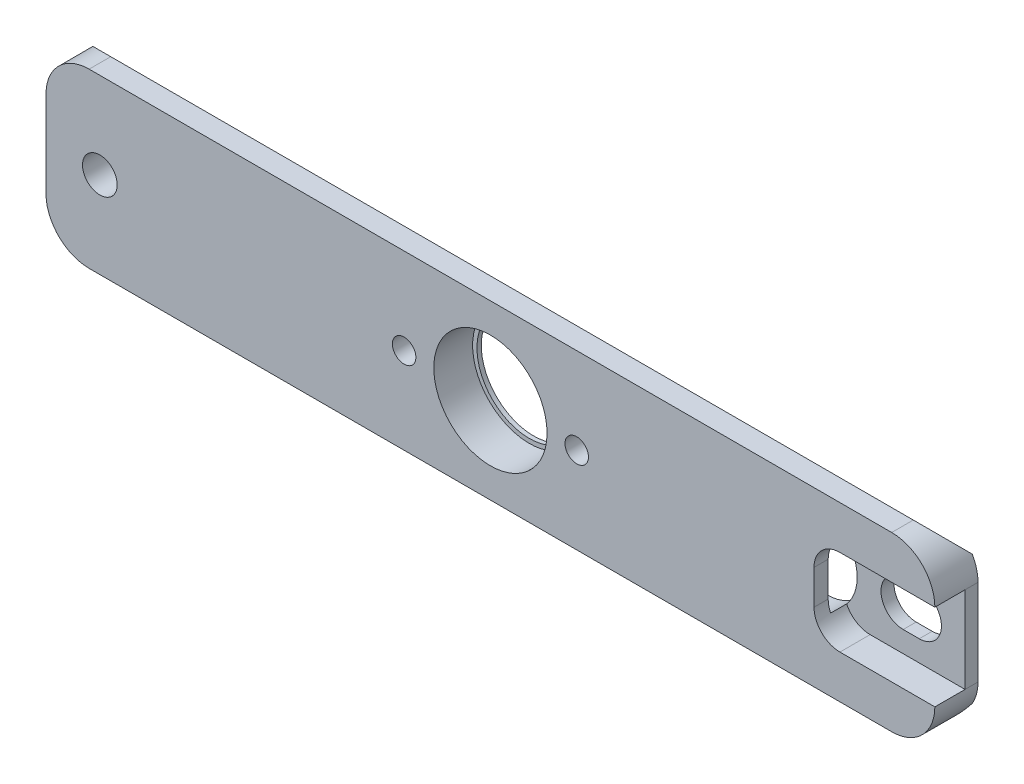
ISO-10303-21;
HEADER;
FILE_DESCRIPTION(('STEP AP214'),'2;1');
FILE_NAME('part.step','',(''),(''),'','','');
FILE_SCHEMA(('AUTOMOTIVE_DESIGN { 1 0 10303 214 1 1 1 1 }'));
ENDSEC;
DATA;
#1=APPLICATION_CONTEXT('core data for automotive mechanical design processes');
#2=APPLICATION_PROTOCOL_DEFINITION('international standard','automotive_design',2000,#1);
#3=PRODUCT_CONTEXT('',#1,'mechanical');
#4=PRODUCT('Part','Part','',(#3));
#5=PRODUCT_RELATED_PRODUCT_CATEGORY('part','',(#4));
#6=PRODUCT_DEFINITION_FORMATION('','',#4);
#7=PRODUCT_DEFINITION_CONTEXT('part definition',#1,'design');
#8=PRODUCT_DEFINITION('design','',#6,#7);
#9=PRODUCT_DEFINITION_SHAPE('','',#8);
#10=(LENGTH_UNIT() NAMED_UNIT(*) SI_UNIT(.MILLI.,.METRE.));
#11=(NAMED_UNIT(*) PLANE_ANGLE_UNIT() SI_UNIT($,.RADIAN.));
#12=(NAMED_UNIT(*) SI_UNIT($,.STERADIAN.) SOLID_ANGLE_UNIT());
#13=UNCERTAINTY_MEASURE_WITH_UNIT(LENGTH_MEASURE(1.E-05),#10,'distance_accuracy_value','');
#14=(GEOMETRIC_REPRESENTATION_CONTEXT(3) GLOBAL_UNCERTAINTY_ASSIGNED_CONTEXT((#13)) GLOBAL_UNIT_ASSIGNED_CONTEXT((#10,
#11,#12)) REPRESENTATION_CONTEXT('',''));
#15=CARTESIAN_POINT('',(0.,0.,0.));
#16=DIRECTION('',(0.,0.,1.));
#17=DIRECTION('',(1.,0.,0.));
#18=AXIS2_PLACEMENT_3D('',#15,#16,#17);
#19=CARTESIAN_POINT('',(47.625,2.54,1.905));
#20=DIRECTION('',(-1.,0.,0.));
#21=DIRECTION('',(0.,0.,1.));
#22=AXIS2_PLACEMENT_3D('',#19,#20,#21);
#23=PLANE('',#22);
#24=DIRECTION('',(0.,-1.,0.));
#25=VECTOR('',#24,1.);
#26=CARTESIAN_POINT('',(47.625,2.54,4.2672));
#27=LINE('',#26,#25);
#28=CARTESIAN_POINT('',(47.625,2.54,4.2672));
#29=VERTEX_POINT('',#28);
#30=CARTESIAN_POINT('',(47.625,-2.54,4.2672));
#31=VERTEX_POINT('',#30);
#32=EDGE_CURVE('E269',#29,#31,#27,.T.);
#33=ORIENTED_EDGE('',*,*,#32,.F.);
#34=DIRECTION('',(0.,0.,1.));
#35=VECTOR('',#34,1.);
#36=CARTESIAN_POINT('',(47.625,2.54,1.905));
#37=LINE('',#36,#35);
#38=CARTESIAN_POINT('',(47.625,2.54,6.35));
#39=VERTEX_POINT('',#38);
#40=EDGE_CURVE('E275',#29,#39,#37,.T.);
#41=ORIENTED_EDGE('',*,*,#40,.T.);
#42=DIRECTION('',(0.,-1.,0.));
#43=VECTOR('',#42,1.);
#44=CARTESIAN_POINT('',(47.625,2.54,6.35));
#45=LINE('',#44,#43);
#46=CARTESIAN_POINT('',(47.625,-2.54,6.35));
#47=VERTEX_POINT('',#46);
#48=EDGE_CURVE('E442',#39,#47,#45,.T.);
#49=ORIENTED_EDGE('',*,*,#48,.T.);
#50=DIRECTION('',(0.,0.,1.));
#51=VECTOR('',#50,1.);
#52=CARTESIAN_POINT('',(47.625,-2.54,1.905));
#53=LINE('',#52,#51);
#54=EDGE_CURVE('E282',#31,#47,#53,.T.);
#55=ORIENTED_EDGE('',*,*,#54,.F.);
#56=EDGE_LOOP('',(#33,#41,#49,#55));
#57=FACE_BOUND('',#56,.T.);
#58=ADVANCED_FACE('F111',(#57),#23,.F.);
#59=CARTESIAN_POINT('',(65.405,12.7,6.35));
#60=DIRECTION('',(-1.,0.,0.));
#61=DIRECTION('',(0.,-1.,0.));
#62=AXIS2_PLACEMENT_3D('',#59,#60,#61);
#63=PLANE('',#62);
#64=DIRECTION('',(0.,1.,0.));
#65=VECTOR('',#64,1.);
#66=CARTESIAN_POINT('',(65.405,12.7,1.905));
#67=LINE('',#66,#65);
#68=CARTESIAN_POINT('',(65.405,-6.35,1.905));
#69=VERTEX_POINT('',#68);
#70=CARTESIAN_POINT('',(65.405,6.35,1.905));
#71=VERTEX_POINT('',#70);
#72=EDGE_CURVE('E296',#69,#71,#67,.T.);
#73=ORIENTED_EDGE('',*,*,#72,.F.);
#74=DIRECTION('',(0.,0.,-1.));
#75=VECTOR('',#74,1.);
#76=CARTESIAN_POINT('',(65.405,-6.35,6.35));
#77=LINE('',#76,#75);
#78=CARTESIAN_POINT('',(65.405,-6.35,0.));
#79=VERTEX_POINT('',#78);
#80=EDGE_CURVE('E373',#69,#79,#77,.T.);
#81=ORIENTED_EDGE('',*,*,#80,.T.);
#82=DIRECTION('',(0.,1.,0.));
#83=VECTOR('',#82,1.);
#84=CARTESIAN_POINT('',(65.405,12.7,0.));
#85=LINE('',#84,#83);
#86=CARTESIAN_POINT('',(65.405,6.35,0.));
#87=VERTEX_POINT('',#86);
#88=EDGE_CURVE('E325',#79,#87,#85,.T.);
#89=ORIENTED_EDGE('',*,*,#88,.T.);
#90=DIRECTION('',(0.,0.,-1.));
#91=VECTOR('',#90,1.);
#92=CARTESIAN_POINT('',(65.405,6.35,6.35));
#93=LINE('',#92,#91);
#94=EDGE_CURVE('E370',#87,#71,#93,.F.);
#95=ORIENTED_EDGE('',*,*,#94,.T.);
#96=EDGE_LOOP('',(#73,#81,#89,#95));
#97=FACE_BOUND('',#96,.T.);
#98=ADVANCED_FACE('F473',(#97),#63,.F.);
#99=CARTESIAN_POINT('',(58.6613,0.,0.));
#100=DIRECTION('',(0.,0.,-1.));
#101=DIRECTION('',(-1.,0.,0.));
#102=AXIS2_PLACEMENT_3D('',#99,#100,#101);
#103=CYLINDRICAL_SURFACE('',#102,3.2639);
#104=CARTESIAN_POINT('',(58.6613,0.,1.905));
#105=DIRECTION('',(0.,0.,1.));
#106=DIRECTION('',(1.,0.,0.));
#107=AXIS2_PLACEMENT_3D('',#104,#105,#106);
#108=CIRCLE('',#107,3.2639);
#109=CARTESIAN_POINT('',(58.6613,3.2639,1.905));
#110=VERTEX_POINT('',#109);
#111=CARTESIAN_POINT('',(58.6613,-3.2639,1.905));
#112=VERTEX_POINT('',#111);
#113=EDGE_CURVE('E292',#110,#112,#108,.F.);
#114=ORIENTED_EDGE('',*,*,#113,.F.);
#115=DIRECTION('',(0.,0.,-1.));
#116=VECTOR('',#115,1.);
#117=CARTESIAN_POINT('',(58.6613,3.2639,0.));
#118=LINE('',#117,#116);
#119=CARTESIAN_POINT('',(58.6613,3.26390000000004,0.));
#120=VERTEX_POINT('',#119);
#121=EDGE_CURVE('E316',#120,#110,#118,.F.);
#122=ORIENTED_EDGE('',*,*,#121,.F.);
#123=CARTESIAN_POINT('',(58.6613,0.,0.));
#124=DIRECTION('',(0.,0.,-1.));
#125=DIRECTION('',(-1.,0.,0.));
#126=AXIS2_PLACEMENT_3D('',#123,#124,#125);
#127=CIRCLE('',#126,3.2639);
#128=CARTESIAN_POINT('',(58.6613,-3.2639,0.));
#129=VERTEX_POINT('',#128);
#130=EDGE_CURVE('E311',#120,#129,#127,.T.);
#131=ORIENTED_EDGE('',*,*,#130,.T.);
#132=DIRECTION('',(0.,0.,-1.));
#133=VECTOR('',#132,1.);
#134=CARTESIAN_POINT('',(58.6613,-3.2639,0.));
#135=LINE('',#134,#133);
#136=EDGE_CURVE('E314',#112,#129,#135,.T.);
#137=ORIENTED_EDGE('',*,*,#136,.F.);
#138=EDGE_LOOP('',(#114,#122,#131,#137));
#139=FACE_BOUND('',#138,.T.);
#140=ADVANCED_FACE('F543',(#139),#103,.F.);
#141=CARTESIAN_POINT('',(56.2991,0.,0.));
#142=DIRECTION('',(0.,0.,-1.));
#143=DIRECTION('',(-1.,0.,0.));
#144=AXIS2_PLACEMENT_3D('',#141,#142,#143);
#145=CYLINDRICAL_SURFACE('',#144,3.2639);
#146=CARTESIAN_POINT('',(56.2991,0.,1.905));
#147=DIRECTION('',(0.,0.,1.));
#148=DIRECTION('',(1.,0.,0.));
#149=AXIS2_PLACEMENT_3D('',#146,#147,#148);
#150=CIRCLE('',#149,3.2639);
#151=CARTESIAN_POINT('',(56.2991,-3.2639,1.905));
#152=VERTEX_POINT('',#151);
#153=CARTESIAN_POINT('',(56.2991,3.2639,1.905));
#154=VERTEX_POINT('',#153);
#155=EDGE_CURVE('E134',#152,#154,#150,.F.);
#156=ORIENTED_EDGE('',*,*,#155,.F.);
#157=DIRECTION('',(0.,0.,-1.));
#158=VECTOR('',#157,1.);
#159=CARTESIAN_POINT('',(56.2991,-3.2639,0.));
#160=LINE('',#159,#158);
#161=CARTESIAN_POINT('',(56.2991,-3.2639,0.));
#162=VERTEX_POINT('',#161);
#163=EDGE_CURVE('E308',#162,#152,#160,.F.);
#164=ORIENTED_EDGE('',*,*,#163,.F.);
#165=CARTESIAN_POINT('',(56.2991,0.,0.));
#166=DIRECTION('',(0.,0.,-1.));
#167=DIRECTION('',(-1.,0.,0.));
#168=AXIS2_PLACEMENT_3D('',#165,#166,#167);
#169=CIRCLE('',#168,3.2639);
#170=CARTESIAN_POINT('',(56.2991,3.2639,0.));
#171=VERTEX_POINT('',#170);
#172=EDGE_CURVE('E303',#162,#171,#169,.T.);
#173=ORIENTED_EDGE('',*,*,#172,.T.);
#174=DIRECTION('',(0.,0.,-1.));
#175=VECTOR('',#174,1.);
#176=CARTESIAN_POINT('',(56.2991,3.2639,0.));
#177=LINE('',#176,#175);
#178=EDGE_CURVE('E306',#154,#171,#177,.T.);
#179=ORIENTED_EDGE('',*,*,#178,.F.);
#180=EDGE_LOOP('',(#156,#164,#173,#179));
#181=FACE_BOUND('',#180,.T.);
#182=ADVANCED_FACE('F560',(#181),#145,.F.);
#183=CARTESIAN_POINT('',(56.2991,-3.2639,0.));
#184=DIRECTION('',(0.,-1.,0.));
#185=DIRECTION('',(0.,0.,-1.));
#186=AXIS2_PLACEMENT_3D('',#183,#184,#185);
#187=PLANE('',#186);
#188=DIRECTION('',(-1.,0.,0.));
#189=VECTOR('',#188,1.);
#190=CARTESIAN_POINT('',(56.2991,-3.2639,1.905));
#191=LINE('',#190,#189);
#192=EDGE_CURVE('E294',#112,#152,#191,.T.);
#193=ORIENTED_EDGE('',*,*,#192,.F.);
#194=ORIENTED_EDGE('',*,*,#136,.T.);
#195=DIRECTION('',(1.,0.,0.));
#196=VECTOR('',#195,1.);
#197=CARTESIAN_POINT('',(56.2991,-3.2639,0.));
#198=LINE('',#197,#196);
#199=EDGE_CURVE('E300',#162,#129,#198,.T.);
#200=ORIENTED_EDGE('',*,*,#199,.F.);
#201=ORIENTED_EDGE('',*,*,#163,.T.);
#202=EDGE_LOOP('',(#193,#194,#200,#201));
#203=FACE_BOUND('',#202,.T.);
#204=ADVANCED_FACE('F556',(#203),#187,.F.);
#205=CARTESIAN_POINT('',(56.2991,3.2639,0.));
#206=DIRECTION('',(0.,1.,0.));
#207=DIRECTION('',(0.,0.,1.));
#208=AXIS2_PLACEMENT_3D('',#205,#206,#207);
#209=PLANE('',#208);
#210=DIRECTION('',(1.,0.,0.));
#211=VECTOR('',#210,1.);
#212=CARTESIAN_POINT('',(56.2991,3.2639,1.905));
#213=LINE('',#212,#211);
#214=EDGE_CURVE('E262',#154,#110,#213,.T.);
#215=ORIENTED_EDGE('',*,*,#214,.F.);
#216=ORIENTED_EDGE('',*,*,#178,.T.);
#217=DIRECTION('',(1.,0.,0.));
#218=VECTOR('',#217,1.);
#219=CARTESIAN_POINT('',(56.2991,3.26390000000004,0.));
#220=LINE('',#219,#218);
#221=EDGE_CURVE('E298',#171,#120,#220,.T.);
#222=ORIENTED_EDGE('',*,*,#221,.T.);
#223=ORIENTED_EDGE('',*,*,#121,.T.);
#224=EDGE_LOOP('',(#215,#216,#222,#223));
#225=FACE_BOUND('',#224,.T.);
#226=ADVANCED_FACE('F553',(#225),#209,.F.);
#227=CARTESIAN_POINT('',(-65.405,12.7,6.35));
#228=DIRECTION('',(0.,-1.,0.));
#229=DIRECTION('',(0.,0.,-1.));
#230=AXIS2_PLACEMENT_3D('',#227,#228,#229);
#231=PLANE('',#230);
#232=DIRECTION('',(0.,0.,-1.));
#233=VECTOR('',#232,1.);
#234=CARTESIAN_POINT('',(59.055,12.7,6.35));
#235=LINE('',#234,#233);
#236=CARTESIAN_POINT('',(59.055,12.7,6.35));
#237=VERTEX_POINT('',#236);
#238=CARTESIAN_POINT('',(59.055,12.7,3.17500000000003));
#239=VERTEX_POINT('',#238);
#240=EDGE_CURVE('E355',#237,#239,#235,.T.);
#241=ORIENTED_EDGE('',*,*,#240,.T.);
#242=DIRECTION('',(-1.,0.,0.));
#243=VECTOR('',#242,1.);
#244=CARTESIAN_POINT('',(-65.405,12.7,3.17500000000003));
#245=LINE('',#244,#243);
#246=CARTESIAN_POINT('',(-59.055,12.7,3.17500000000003));
#247=VERTEX_POINT('',#246);
#248=EDGE_CURVE('E392',#239,#247,#245,.T.);
#249=ORIENTED_EDGE('',*,*,#248,.T.);
#250=DIRECTION('',(0.,0.,-1.));
#251=VECTOR('',#250,1.);
#252=CARTESIAN_POINT('',(-59.055,12.7,6.35));
#253=LINE('',#252,#251);
#254=CARTESIAN_POINT('',(-59.055,12.7,6.35));
#255=VERTEX_POINT('',#254);
#256=EDGE_CURVE('E358',#247,#255,#253,.F.);
#257=ORIENTED_EDGE('',*,*,#256,.T.);
#258=DIRECTION('',(-1.,0.,0.));
#259=VECTOR('',#258,1.);
#260=CARTESIAN_POINT('',(-65.405,12.7,6.35));
#261=LINE('',#260,#259);
#262=EDGE_CURVE('E326',#237,#255,#261,.T.);
#263=ORIENTED_EDGE('',*,*,#262,.F.);
#264=EDGE_LOOP('',(#241,#249,#257,#263));
#265=FACE_BOUND('',#264,.T.);
#266=ADVANCED_FACE('F535',(#265),#231,.F.);
#267=CARTESIAN_POINT('',(-65.405,12.7,6.35));
#268=DIRECTION('',(1.,0.,0.));
#269=DIRECTION('',(0.,0.,-1.));
#270=AXIS2_PLACEMENT_3D('',#267,#268,#269);
#271=PLANE('',#270);
#272=DIRECTION('',(0.,-1.,0.));
#273=VECTOR('',#272,1.);
#274=CARTESIAN_POINT('',(-65.405,12.7,6.35));
#275=LINE('',#274,#273);
#276=CARTESIAN_POINT('',(-65.405,6.35,6.35));
#277=VERTEX_POINT('',#276);
#278=CARTESIAN_POINT('',(-65.405,-6.35,6.35));
#279=VERTEX_POINT('',#278);
#280=EDGE_CURVE('E329',#277,#279,#275,.T.);
#281=ORIENTED_EDGE('',*,*,#280,.F.);
#282=DIRECTION('',(0.,0.,-1.));
#283=VECTOR('',#282,1.);
#284=CARTESIAN_POINT('',(-65.405,6.35,6.35));
#285=LINE('',#284,#283);
#286=CARTESIAN_POINT('',(-65.405,6.35,0.));
#287=VERTEX_POINT('',#286);
#288=EDGE_CURVE('E342',#277,#287,#285,.T.);
#289=ORIENTED_EDGE('',*,*,#288,.T.);
#290=DIRECTION('',(0.,-1.,0.));
#291=VECTOR('',#290,1.);
#292=CARTESIAN_POINT('',(-65.405,12.7,0.));
#293=LINE('',#292,#291);
#294=CARTESIAN_POINT('',(-65.405,-6.35,0.));
#295=VERTEX_POINT('',#294);
#296=EDGE_CURVE('E330',#287,#295,#293,.T.);
#297=ORIENTED_EDGE('',*,*,#296,.T.);
#298=DIRECTION('',(0.,0.,-1.));
#299=VECTOR('',#298,1.);
#300=CARTESIAN_POINT('',(-65.405,-6.35,6.35));
#301=LINE('',#300,#299);
#302=EDGE_CURVE('E336',#295,#279,#301,.F.);
#303=ORIENTED_EDGE('',*,*,#302,.T.);
#304=EDGE_LOOP('',(#281,#289,#297,#303));
#305=FACE_BOUND('',#304,.T.);
#306=ADVANCED_FACE('F527',(#305),#271,.F.);
#307=CARTESIAN_POINT('',(-65.405,-12.7,6.35));
#308=DIRECTION('',(0.,1.,0.));
#309=DIRECTION('',(0.,0.,1.));
#310=AXIS2_PLACEMENT_3D('',#307,#308,#309);
#311=PLANE('',#310);
#312=DIRECTION('',(0.,0.,-1.));
#313=VECTOR('',#312,1.);
#314=CARTESIAN_POINT('',(-59.055,-12.7,6.35));
#315=LINE('',#314,#313);
#316=CARTESIAN_POINT('',(-59.055,-12.7,6.35));
#317=VERTEX_POINT('',#316);
#318=CARTESIAN_POINT('',(-59.055,-12.7,3.175));
#319=VERTEX_POINT('',#318);
#320=EDGE_CURVE('E376',#317,#319,#315,.T.);
#321=ORIENTED_EDGE('',*,*,#320,.T.);
#322=DIRECTION('',(1.,0.,0.));
#323=VECTOR('',#322,1.);
#324=CARTESIAN_POINT('',(-65.405,-12.7,3.175));
#325=LINE('',#324,#323);
#326=CARTESIAN_POINT('',(59.055,-12.7,3.175));
#327=VERTEX_POINT('',#326);
#328=EDGE_CURVE('E381',#319,#327,#325,.T.);
#329=ORIENTED_EDGE('',*,*,#328,.T.);
#330=DIRECTION('',(0.,0.,-1.));
#331=VECTOR('',#330,1.);
#332=CARTESIAN_POINT('',(59.055,-12.7,6.35));
#333=LINE('',#332,#331);
#334=CARTESIAN_POINT('',(59.055,-12.7,6.35));
#335=VERTEX_POINT('',#334);
#336=EDGE_CURVE('E379',#327,#335,#333,.F.);
#337=ORIENTED_EDGE('',*,*,#336,.T.);
#338=DIRECTION('',(1.,0.,0.));
#339=VECTOR('',#338,1.);
#340=CARTESIAN_POINT('',(-65.405,-12.7,6.35));
#341=LINE('',#340,#339);
#342=EDGE_CURVE('E333',#317,#335,#341,.T.);
#343=ORIENTED_EDGE('',*,*,#342,.F.);
#344=EDGE_LOOP('',(#321,#329,#337,#343));
#345=FACE_BOUND('',#344,.T.);
#346=ADVANCED_FACE('F525',(#345),#311,.F.);
#347=CARTESIAN_POINT('',(0.,0.,6.35));
#348=DIRECTION('',(0.,0.,1.));
#349=DIRECTION('',(1.,0.,0.));
#350=AXIS2_PLACEMENT_3D('',#347,#348,#349);
#351=PLANE('',#350);
#352=CARTESIAN_POINT('',(0.,0.,6.35));
#353=DIRECTION('',(0.,0.,1.));
#354=DIRECTION('',(1.,0.,0.));
#355=AXIS2_PLACEMENT_3D('',#352,#353,#354);
#356=CIRCLE('',#355,8.334375);
#357=CARTESIAN_POINT('',(8.334375,0.,6.35));
#358=VERTEX_POINT('',#357);
#359=EDGE_CURVE('E402',#358,#358,#356,.T.);
#360=ORIENTED_EDGE('',*,*,#359,.F.);
#361=EDGE_LOOP('',(#360));
#362=FACE_BOUND('',#361,.T.);
#363=CARTESIAN_POINT('',(12.7,0.,6.35));
#364=DIRECTION('',(0.,0.,-1.));
#365=DIRECTION('',(-1.,0.,0.));
#366=AXIS2_PLACEMENT_3D('',#363,#364,#365);
#367=CIRCLE('',#366,1.7272);
#368=CARTESIAN_POINT('',(10.9728,0.,6.35));
#369=VERTEX_POINT('',#368);
#370=EDGE_CURVE('E422',#369,#369,#367,.T.);
#371=ORIENTED_EDGE('',*,*,#370,.T.);
#372=EDGE_LOOP('',(#371));
#373=FACE_BOUND('',#372,.T.);
#374=CARTESIAN_POINT('',(-12.7,0.,6.35));
#375=DIRECTION('',(0.,0.,-1.));
#376=DIRECTION('',(-1.,0.,0.));
#377=AXIS2_PLACEMENT_3D('',#374,#375,#376);
#378=CIRCLE('',#377,1.7272);
#379=CARTESIAN_POINT('',(-14.4272,0.,6.35));
#380=VERTEX_POINT('',#379);
#381=EDGE_CURVE('E428',#380,#380,#378,.T.);
#382=ORIENTED_EDGE('',*,*,#381,.T.);
#383=EDGE_LOOP('',(#382));
#384=FACE_BOUND('',#383,.T.);
#385=DIRECTION('',(1.,0.,0.));
#386=VECTOR('',#385,1.);
#387=CARTESIAN_POINT('',(51.435,-6.35,6.35));
#388=LINE('',#387,#386);
#389=CARTESIAN_POINT('',(51.435,-6.35,6.35));
#390=VERTEX_POINT('',#389);
#391=CARTESIAN_POINT('',(65.405,-6.35,6.35));
#392=VERTEX_POINT('',#391);
#393=EDGE_CURVE('E434',#390,#392,#388,.T.);
#394=ORIENTED_EDGE('',*,*,#393,.F.);
#395=CARTESIAN_POINT('',(51.435,-2.54,6.35));
#396=DIRECTION('',(0.,0.,1.));
#397=DIRECTION('',(1.,0.,0.));
#398=AXIS2_PLACEMENT_3D('',#395,#396,#397);
#399=CIRCLE('',#398,3.81);
#400=EDGE_CURVE('E444',#47,#390,#399,.T.);
#401=ORIENTED_EDGE('',*,*,#400,.F.);
#402=ORIENTED_EDGE('',*,*,#48,.F.);
#403=CARTESIAN_POINT('',(51.435,2.54,6.35));
#404=DIRECTION('',(0.,0.,1.));
#405=DIRECTION('',(1.,0.,0.));
#406=AXIS2_PLACEMENT_3D('',#403,#404,#405);
#407=CIRCLE('',#406,3.81);
#408=CARTESIAN_POINT('',(51.435,6.35,6.35));
#409=VERTEX_POINT('',#408);
#410=EDGE_CURVE('E278',#409,#39,#407,.T.);
#411=ORIENTED_EDGE('',*,*,#410,.F.);
#412=DIRECTION('',(-1.,0.,0.));
#413=VECTOR('',#412,1.);
#414=CARTESIAN_POINT('',(51.435,6.35,6.35));
#415=LINE('',#414,#413);
#416=CARTESIAN_POINT('',(65.405,6.35,6.35));
#417=VERTEX_POINT('',#416);
#418=EDGE_CURVE('E431',#417,#409,#415,.T.);
#419=ORIENTED_EDGE('',*,*,#418,.F.);
#420=CARTESIAN_POINT('',(59.055,6.35,6.35));
#421=DIRECTION('',(0.,0.,1.));
#422=DIRECTION('',(1.,0.,0.));
#423=AXIS2_PLACEMENT_3D('',#420,#421,#422);
#424=CIRCLE('',#423,6.35);
#425=EDGE_CURVE('E360',#417,#237,#424,.T.);
#426=ORIENTED_EDGE('',*,*,#425,.T.);
#427=ORIENTED_EDGE('',*,*,#262,.T.);
#428=CARTESIAN_POINT('',(-59.055,6.35,6.35));
#429=DIRECTION('',(0.,0.,1.));
#430=DIRECTION('',(1.,0.,0.));
#431=AXIS2_PLACEMENT_3D('',#428,#429,#430);
#432=CIRCLE('',#431,6.35);
#433=EDGE_CURVE('E367',#255,#277,#432,.T.);
#434=ORIENTED_EDGE('',*,*,#433,.T.);
#435=ORIENTED_EDGE('',*,*,#280,.T.);
#436=CARTESIAN_POINT('',(-59.055,-6.35,6.35));
#437=DIRECTION('',(0.,0.,1.));
#438=DIRECTION('',(1.,0.,0.));
#439=AXIS2_PLACEMENT_3D('',#436,#437,#438);
#440=CIRCLE('',#439,6.35);
#441=EDGE_CURVE('E362',#279,#317,#440,.T.);
#442=ORIENTED_EDGE('',*,*,#441,.T.);
#443=ORIENTED_EDGE('',*,*,#342,.T.);
#444=CARTESIAN_POINT('',(59.055,-6.35,6.35));
#445=DIRECTION('',(0.,0.,1.));
#446=DIRECTION('',(1.,0.,0.));
#447=AXIS2_PLACEMENT_3D('',#444,#445,#446);
#448=CIRCLE('',#447,6.35);
#449=EDGE_CURVE('E364',#335,#392,#448,.T.);
#450=ORIENTED_EDGE('',*,*,#449,.T.);
#451=EDGE_LOOP('',(#394,#401,#402,#411,#419,#426,#427,#434,#435,#442,#443,#450));
#452=FACE_BOUND('',#451,.T.);
#453=CARTESIAN_POINT('',(-57.4802,0.,6.35));
#454=DIRECTION('',(0.,0.,1.));
#455=DIRECTION('',(1.,0.,0.));
#456=AXIS2_PLACEMENT_3D('',#453,#454,#455);
#457=CIRCLE('',#456,2.5527);
#458=CARTESIAN_POINT('',(-54.9275,0.,6.35));
#459=VERTEX_POINT('',#458);
#460=EDGE_CURVE('E319',#459,#459,#457,.T.);
#461=ORIENTED_EDGE('',*,*,#460,.F.);
#462=EDGE_LOOP('',(#461));
#463=FACE_BOUND('',#462,.T.);
#464=ADVANCED_FACE('F458',(#362,#373,#384,#452,#463),#351,.T.);
#465=CARTESIAN_POINT('',(0.,0.,0.));
#466=DIRECTION('',(0.,0.,1.));
#467=DIRECTION('',(1.,0.,0.));
#468=AXIS2_PLACEMENT_3D('',#465,#466,#467);
#469=PLANE('',#468);
#470=CARTESIAN_POINT('',(-43.18,0.,0.));
#471=DIRECTION('',(0.,0.,-1.));
#472=DIRECTION('',(-1.,0.,0.));
#473=AXIS2_PLACEMENT_3D('',#470,#471,#472);
#474=CIRCLE('',#473,6.35);
#475=CARTESIAN_POINT('',(-49.53,0.,0.));
#476=VERTEX_POINT('',#475);
#477=EDGE_CURVE('E490',#476,#476,#474,.T.);
#478=ORIENTED_EDGE('',*,*,#477,.F.);
#479=EDGE_LOOP('',(#478));
#480=FACE_BOUND('',#479,.T.);
#481=CARTESIAN_POINT('',(43.18,0.,0.));
#482=DIRECTION('',(0.,0.,-1.));
#483=DIRECTION('',(1.,0.,0.));
#484=AXIS2_PLACEMENT_3D('',#481,#482,#483);
#485=CIRCLE('',#484,6.35);
#486=CARTESIAN_POINT('',(49.53,0.,0.));
#487=VERTEX_POINT('',#486);
#488=EDGE_CURVE('E486',#487,#487,#485,.T.);
#489=ORIENTED_EDGE('',*,*,#488,.F.);
#490=EDGE_LOOP('',(#489));
#491=FACE_BOUND('',#490,.T.);
#492=CARTESIAN_POINT('',(0.,0.,0.));
#493=DIRECTION('',(0.,0.,1.));
#494=DIRECTION('',(1.,0.,0.));
#495=AXIS2_PLACEMENT_3D('',#492,#493,#494);
#496=CIRCLE('',#495,7.699375);
#497=CARTESIAN_POINT('',(7.699375,0.,0.));
#498=VERTEX_POINT('',#497);
#499=EDGE_CURVE('E400',#498,#498,#496,.T.);
#500=ORIENTED_EDGE('',*,*,#499,.T.);
#501=EDGE_LOOP('',(#500));
#502=FACE_BOUND('',#501,.T.);
#503=CARTESIAN_POINT('',(12.7,0.,0.));
#504=DIRECTION('',(0.,0.,-1.));
#505=DIRECTION('',(-1.,0.,0.));
#506=AXIS2_PLACEMENT_3D('',#503,#504,#505);
#507=CIRCLE('',#506,1.7272);
#508=CARTESIAN_POINT('',(10.9728,0.,0.));
#509=VERTEX_POINT('',#508);
#510=EDGE_CURVE('E418',#509,#509,#507,.T.);
#511=ORIENTED_EDGE('',*,*,#510,.F.);
#512=EDGE_LOOP('',(#511));
#513=FACE_BOUND('',#512,.T.);
#514=CARTESIAN_POINT('',(-12.7,0.,0.));
#515=DIRECTION('',(0.,0.,-1.));
#516=DIRECTION('',(-1.,0.,0.));
#517=AXIS2_PLACEMENT_3D('',#514,#515,#516);
#518=CIRCLE('',#517,1.7272);
#519=CARTESIAN_POINT('',(-14.4272,0.,0.));
#520=VERTEX_POINT('',#519);
#521=EDGE_CURVE('E425',#520,#520,#518,.T.);
#522=ORIENTED_EDGE('',*,*,#521,.F.);
#523=EDGE_LOOP('',(#522));
#524=FACE_BOUND('',#523,.T.);
#525=ORIENTED_EDGE('',*,*,#199,.T.);
#526=ORIENTED_EDGE('',*,*,#130,.F.);
#527=ORIENTED_EDGE('',*,*,#221,.F.);
#528=ORIENTED_EDGE('',*,*,#172,.F.);
#529=EDGE_LOOP('',(#525,#526,#527,#528));
#530=FACE_BOUND('',#529,.T.);
#531=CARTESIAN_POINT('',(-57.4802,0.,0.));
#532=DIRECTION('',(0.,0.,1.));
#533=DIRECTION('',(1.,0.,0.));
#534=AXIS2_PLACEMENT_3D('',#531,#532,#533);
#535=CIRCLE('',#534,2.5527);
#536=CARTESIAN_POINT('',(-54.9275,0.,0.));
#537=VERTEX_POINT('',#536);
#538=EDGE_CURVE('E322',#537,#537,#535,.T.);
#539=ORIENTED_EDGE('',*,*,#538,.T.);
#540=EDGE_LOOP('',(#539));
#541=FACE_BOUND('',#540,.T.);
#542=CARTESIAN_POINT('',(59.055,-6.35,0.));
#543=DIRECTION('',(0.,0.,1.));
#544=DIRECTION('',(1.,0.,0.));
#545=AXIS2_PLACEMENT_3D('',#542,#543,#544);
#546=CIRCLE('',#545,6.35);
#547=CARTESIAN_POINT('',(64.5542613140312,-9.52499999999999,0.));
#548=VERTEX_POINT('',#547);
#549=EDGE_CURVE('E349',#79,#548,#546,.F.);
#550=ORIENTED_EDGE('',*,*,#549,.T.);
#551=DIRECTION('',(-1.,0.,0.));
#552=VECTOR('',#551,1.);
#553=CARTESIAN_POINT('',(0.,-9.52499999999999,0.));
#554=LINE('',#553,#552);
#555=CARTESIAN_POINT('',(-64.5542613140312,-9.52499999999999,0.));
#556=VERTEX_POINT('',#555);
#557=EDGE_CURVE('E388',#548,#556,#554,.T.);
#558=ORIENTED_EDGE('',*,*,#557,.T.);
#559=CARTESIAN_POINT('',(-59.055,-6.35,0.));
#560=DIRECTION('',(0.,0.,1.));
#561=DIRECTION('',(1.,0.,0.));
#562=AXIS2_PLACEMENT_3D('',#559,#560,#561);
#563=CIRCLE('',#562,6.35);
#564=EDGE_CURVE('E347',#556,#295,#563,.F.);
#565=ORIENTED_EDGE('',*,*,#564,.T.);
#566=ORIENTED_EDGE('',*,*,#296,.F.);
#567=CARTESIAN_POINT('',(-59.055,6.35,0.));
#568=DIRECTION('',(0.,0.,1.));
#569=DIRECTION('',(1.,0.,0.));
#570=AXIS2_PLACEMENT_3D('',#567,#568,#569);
#571=CIRCLE('',#570,6.35);
#572=CARTESIAN_POINT('',(-64.5542613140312,9.52499999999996,0.));
#573=VERTEX_POINT('',#572);
#574=EDGE_CURVE('E352',#287,#573,#571,.F.);
#575=ORIENTED_EDGE('',*,*,#574,.T.);
#576=DIRECTION('',(1.,0.,0.));
#577=VECTOR('',#576,1.);
#578=CARTESIAN_POINT('',(0.,9.52499999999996,0.));
#579=LINE('',#578,#577);
#580=CARTESIAN_POINT('',(64.5542613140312,9.52499999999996,0.));
#581=VERTEX_POINT('',#580);
#582=EDGE_CURVE('E386',#573,#581,#579,.T.);
#583=ORIENTED_EDGE('',*,*,#582,.T.);
#584=CARTESIAN_POINT('',(59.055,6.35,0.));
#585=DIRECTION('',(0.,0.,1.));
#586=DIRECTION('',(1.,0.,0.));
#587=AXIS2_PLACEMENT_3D('',#584,#585,#586);
#588=CIRCLE('',#587,6.35);
#589=EDGE_CURVE('E345',#581,#87,#588,.F.);
#590=ORIENTED_EDGE('',*,*,#589,.T.);
#591=ORIENTED_EDGE('',*,*,#88,.F.);
#592=EDGE_LOOP('',(#550,#558,#565,#566,#575,#583,#590,#591));
#593=FACE_BOUND('',#592,.T.);
#594=ADVANCED_FACE('F497',(#480,#491,#502,#513,#524,#530,#541,#593),#469,.F.);
#595=CARTESIAN_POINT('',(-57.4802,0.,6.35));
#596=DIRECTION('',(0.,0.,1.));
#597=DIRECTION('',(1.,0.,0.));
#598=AXIS2_PLACEMENT_3D('',#595,#596,#597);
#599=CYLINDRICAL_SURFACE('',#598,2.5527);
#600=ORIENTED_EDGE('',*,*,#538,.F.);
#601=EDGE_LOOP('',(#600));
#602=FACE_BOUND('',#601,.T.);
#603=ORIENTED_EDGE('',*,*,#460,.T.);
#604=EDGE_LOOP('',(#603));
#605=FACE_BOUND('',#604,.T.);
#606=ADVANCED_FACE('F499',(#602,#605),#599,.F.);
#607=CARTESIAN_POINT('',(-59.055,6.35,6.35));
#608=DIRECTION('',(0.,0.,-1.));
#609=DIRECTION('',(-1.,0.,0.));
#610=AXIS2_PLACEMENT_3D('',#607,#608,#609);
#611=CYLINDRICAL_SURFACE('',#610,6.35);
#612=ORIENTED_EDGE('',*,*,#256,.F.);
#613=CARTESIAN_POINT('',(-59.055,6.35,-3.17499999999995));
#614=DIRECTION('',(0.,-0.707106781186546,0.707106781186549));
#615=DIRECTION('',(0.,-0.707106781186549,-0.707106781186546));
#616=AXIS2_PLACEMENT_3D('',#613,#614,#615);
#617=ELLIPSE('',#616,8.98025612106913,6.35);
#618=EDGE_CURVE('E395',#247,#573,#617,.T.);
#619=ORIENTED_EDGE('',*,*,#618,.T.);
#620=ORIENTED_EDGE('',*,*,#574,.F.);
#621=ORIENTED_EDGE('',*,*,#288,.F.);
#622=ORIENTED_EDGE('',*,*,#433,.F.);
#623=EDGE_LOOP('',(#612,#619,#620,#621,#622));
#624=FACE_BOUND('',#623,.T.);
#625=ADVANCED_FACE('F569',(#624),#611,.T.);
#626=CARTESIAN_POINT('',(59.055,-6.35,6.35));
#627=DIRECTION('',(0.,0.,-1.));
#628=DIRECTION('',(-1.,0.,0.));
#629=AXIS2_PLACEMENT_3D('',#626,#627,#628);
#630=CYLINDRICAL_SURFACE('',#629,6.35);
#631=ORIENTED_EDGE('',*,*,#336,.F.);
#632=CARTESIAN_POINT('',(59.055,-6.35,-3.17499999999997));
#633=DIRECTION('',(0.,0.707106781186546,0.707106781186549));
#634=DIRECTION('',(0.,0.707106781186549,-0.707106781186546));
#635=AXIS2_PLACEMENT_3D('',#632,#633,#634);
#636=ELLIPSE('',#635,8.98025612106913,6.35);
#637=EDGE_CURVE('E384',#327,#548,#636,.T.);
#638=ORIENTED_EDGE('',*,*,#637,.T.);
#639=ORIENTED_EDGE('',*,*,#549,.F.);
#640=ORIENTED_EDGE('',*,*,#80,.F.);
#641=EDGE_CURVE('E374',#392,#69,#77,.T.);
#642=ORIENTED_EDGE('',*,*,#641,.F.);
#643=ORIENTED_EDGE('',*,*,#449,.F.);
#644=EDGE_LOOP('',(#631,#638,#639,#640,#642,#643));
#645=FACE_BOUND('',#644,.T.);
#646=ADVANCED_FACE('F466',(#645),#630,.T.);
#647=CARTESIAN_POINT('',(-59.055,-6.35,6.35));
#648=DIRECTION('',(0.,0.,-1.));
#649=DIRECTION('',(-1.,0.,0.));
#650=AXIS2_PLACEMENT_3D('',#647,#648,#649);
#651=CYLINDRICAL_SURFACE('',#650,6.35);
#652=ORIENTED_EDGE('',*,*,#564,.F.);
#653=CARTESIAN_POINT('',(-59.055,-6.35,-3.17499999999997));
#654=DIRECTION('',(0.,0.707106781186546,0.707106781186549));
#655=DIRECTION('',(0.,0.707106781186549,-0.707106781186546));
#656=AXIS2_PLACEMENT_3D('',#653,#654,#655);
#657=ELLIPSE('',#656,8.98025612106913,6.35);
#658=EDGE_CURVE('E390',#556,#319,#657,.T.);
#659=ORIENTED_EDGE('',*,*,#658,.T.);
#660=ORIENTED_EDGE('',*,*,#320,.F.);
#661=ORIENTED_EDGE('',*,*,#441,.F.);
#662=ORIENTED_EDGE('',*,*,#302,.F.);
#663=EDGE_LOOP('',(#652,#659,#660,#661,#662));
#664=FACE_BOUND('',#663,.T.);
#665=ADVANCED_FACE('F521',(#664),#651,.T.);
#666=CARTESIAN_POINT('',(59.055,6.35,6.35));
#667=DIRECTION('',(0.,0.,-1.));
#668=DIRECTION('',(-1.,0.,0.));
#669=AXIS2_PLACEMENT_3D('',#666,#667,#668);
#670=CYLINDRICAL_SURFACE('',#669,6.35);
#671=ORIENTED_EDGE('',*,*,#589,.F.);
#672=CARTESIAN_POINT('',(59.055,6.35,-3.17499999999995));
#673=DIRECTION('',(0.,-0.707106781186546,0.707106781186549));
#674=DIRECTION('',(0.,-0.707106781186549,-0.707106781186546));
#675=AXIS2_PLACEMENT_3D('',#672,#673,#674);
#676=ELLIPSE('',#675,8.98025612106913,6.35);
#677=EDGE_CURVE('E397',#581,#239,#676,.T.);
#678=ORIENTED_EDGE('',*,*,#677,.T.);
#679=ORIENTED_EDGE('',*,*,#240,.F.);
#680=ORIENTED_EDGE('',*,*,#425,.F.);
#681=EDGE_CURVE('E369',#71,#417,#93,.F.);
#682=ORIENTED_EDGE('',*,*,#681,.F.);
#683=ORIENTED_EDGE('',*,*,#94,.F.);
#684=EDGE_LOOP('',(#671,#678,#679,#680,#682,#683));
#685=FACE_BOUND('',#684,.T.);
#686=ADVANCED_FACE('F478',(#685),#670,.T.);
#687=CARTESIAN_POINT('',(-65.405,-12.7,3.175));
#688=DIRECTION('',(0.,0.707106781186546,0.707106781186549));
#689=DIRECTION('',(1.,0.,0.));
#690=AXIS2_PLACEMENT_3D('',#687,#688,#689);
#691=PLANE('',#690);
#692=ORIENTED_EDGE('',*,*,#658,.F.);
#693=ORIENTED_EDGE('',*,*,#557,.F.);
#694=ORIENTED_EDGE('',*,*,#637,.F.);
#695=ORIENTED_EDGE('',*,*,#328,.F.);
#696=EDGE_LOOP('',(#692,#693,#694,#695));
#697=FACE_BOUND('',#696,.T.);
#698=ADVANCED_FACE('F517',(#697),#691,.F.);
#699=CARTESIAN_POINT('',(-65.405,12.7,3.17500000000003));
#700=DIRECTION('',(0.,-0.707106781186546,0.707106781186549));
#701=DIRECTION('',(-1.,0.,0.));
#702=AXIS2_PLACEMENT_3D('',#699,#700,#701);
#703=PLANE('',#702);
#704=ORIENTED_EDGE('',*,*,#677,.F.);
#705=ORIENTED_EDGE('',*,*,#582,.F.);
#706=ORIENTED_EDGE('',*,*,#618,.F.);
#707=ORIENTED_EDGE('',*,*,#248,.F.);
#708=EDGE_LOOP('',(#704,#705,#706,#707));
#709=FACE_BOUND('',#708,.T.);
#710=ADVANCED_FACE('F113',(#709),#703,.F.);
#711=CARTESIAN_POINT('',(51.435,-2.54,1.905));
#712=DIRECTION('',(0.,0.,1.));
#713=DIRECTION('',(1.,0.,0.));
#714=AXIS2_PLACEMENT_3D('',#711,#712,#713);
#715=PLANE('',#714);
#716=CARTESIAN_POINT('',(43.18,0.,1.905));
#717=DIRECTION('',(0.,0.,1.));
#718=DIRECTION('',(1.,0.,0.));
#719=AXIS2_PLACEMENT_3D('',#716,#717,#718);
#720=CIRCLE('',#719,6.35);
#721=CARTESIAN_POINT('',(47.9834149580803,-4.15327638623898,1.905));
#722=VERTEX_POINT('',#721);
#723=CARTESIAN_POINT('',(47.9834149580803,4.15327638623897,1.905));
#724=VERTEX_POINT('',#723);
#725=EDGE_CURVE('E257',#722,#724,#720,.T.);
#726=ORIENTED_EDGE('',*,*,#725,.F.);
#727=CARTESIAN_POINT('',(51.435,-2.54,1.905));
#728=DIRECTION('',(0.,0.,1.));
#729=DIRECTION('',(1.,0.,0.));
#730=AXIS2_PLACEMENT_3D('',#727,#728,#729);
#731=CIRCLE('',#730,3.81);
#732=CARTESIAN_POINT('',(51.435,-6.35,1.905));
#733=VERTEX_POINT('',#732);
#734=EDGE_CURVE('E436',#722,#733,#731,.T.);
#735=ORIENTED_EDGE('',*,*,#734,.T.);
#736=DIRECTION('',(1.,0.,0.));
#737=VECTOR('',#736,1.);
#738=CARTESIAN_POINT('',(51.435,-6.35,1.905));
#739=LINE('',#738,#737);
#740=EDGE_CURVE('E287',#733,#69,#739,.T.);
#741=ORIENTED_EDGE('',*,*,#740,.T.);
#742=ORIENTED_EDGE('',*,*,#72,.T.);
#743=DIRECTION('',(-1.,0.,0.));
#744=VECTOR('',#743,1.);
#745=CARTESIAN_POINT('',(51.435,6.35,1.905));
#746=LINE('',#745,#744);
#747=CARTESIAN_POINT('',(51.435,6.35,1.905));
#748=VERTEX_POINT('',#747);
#749=EDGE_CURVE('E126',#71,#748,#746,.T.);
#750=ORIENTED_EDGE('',*,*,#749,.T.);
#751=CARTESIAN_POINT('',(51.435,2.54,1.905));
#752=DIRECTION('',(0.,0.,1.));
#753=DIRECTION('',(1.,0.,0.));
#754=AXIS2_PLACEMENT_3D('',#751,#752,#753);
#755=CIRCLE('',#754,3.81);
#756=EDGE_CURVE('E433',#748,#724,#755,.T.);
#757=ORIENTED_EDGE('',*,*,#756,.T.);
#758=EDGE_LOOP('',(#726,#735,#741,#742,#750,#757));
#759=FACE_BOUND('',#758,.T.);
#760=ORIENTED_EDGE('',*,*,#192,.T.);
#761=ORIENTED_EDGE('',*,*,#155,.T.);
#762=ORIENTED_EDGE('',*,*,#214,.T.);
#763=ORIENTED_EDGE('',*,*,#113,.T.);
#764=EDGE_LOOP('',(#760,#761,#762,#763));
#765=FACE_BOUND('',#764,.T.);
#766=ADVANCED_FACE('F470',(#759,#765),#715,.T.);
#767=CARTESIAN_POINT('',(51.435,-6.35,1.905));
#768=DIRECTION('',(0.,-1.,0.));
#769=DIRECTION('',(1.,0.,0.));
#770=AXIS2_PLACEMENT_3D('',#767,#768,#769);
#771=PLANE('',#770);
#772=ORIENTED_EDGE('',*,*,#641,.T.);
#773=ORIENTED_EDGE('',*,*,#740,.F.);
#774=DIRECTION('',(0.,0.,1.));
#775=VECTOR('',#774,1.);
#776=CARTESIAN_POINT('',(51.435,-6.35,1.905));
#777=LINE('',#776,#775);
#778=EDGE_CURVE('E285',#733,#390,#777,.T.);
#779=ORIENTED_EDGE('',*,*,#778,.T.);
#780=ORIENTED_EDGE('',*,*,#393,.T.);
#781=EDGE_LOOP('',(#772,#773,#779,#780));
#782=FACE_BOUND('',#781,.T.);
#783=ADVANCED_FACE('F450',(#782),#771,.F.);
#784=CARTESIAN_POINT('',(51.435,-2.54,1.905));
#785=DIRECTION('',(0.,0.,1.));
#786=DIRECTION('',(1.,0.,0.));
#787=AXIS2_PLACEMENT_3D('',#784,#785,#786);
#788=CYLINDRICAL_SURFACE('',#787,3.81);
#789=DIRECTION('',(0.,0.,-1.));
#790=VECTOR('',#789,1.);
#791=CARTESIAN_POINT('',(47.9834149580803,-4.15327638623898,1.27));
#792=LINE('',#791,#790);
#793=CARTESIAN_POINT('',(47.9834149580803,-4.15327638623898,4.2672));
#794=VERTEX_POINT('',#793);
#795=EDGE_CURVE('E410',#722,#794,#792,.F.);
#796=ORIENTED_EDGE('',*,*,#795,.T.);
#797=CARTESIAN_POINT('',(51.435,-2.54,4.2672));
#798=DIRECTION('',(0.,0.,-1.));
#799=DIRECTION('',(-1.,0.,0.));
#800=AXIS2_PLACEMENT_3D('',#797,#798,#799);
#801=CIRCLE('',#800,3.81);
#802=EDGE_CURVE('E268',#31,#794,#801,.F.);
#803=ORIENTED_EDGE('',*,*,#802,.F.);
#804=ORIENTED_EDGE('',*,*,#54,.T.);
#805=ORIENTED_EDGE('',*,*,#400,.T.);
#806=ORIENTED_EDGE('',*,*,#778,.F.);
#807=ORIENTED_EDGE('',*,*,#734,.F.);
#808=EDGE_LOOP('',(#796,#803,#804,#805,#806,#807));
#809=FACE_BOUND('',#808,.T.);
#810=ADVANCED_FACE('F455',(#809),#788,.F.);
#811=CARTESIAN_POINT('',(51.435,2.54,1.905));
#812=DIRECTION('',(0.,0.,1.));
#813=DIRECTION('',(1.,0.,0.));
#814=AXIS2_PLACEMENT_3D('',#811,#812,#813);
#815=CYLINDRICAL_SURFACE('',#814,3.81);
#816=CARTESIAN_POINT('',(51.435,2.54,4.2672));
#817=DIRECTION('',(0.,0.,-1.));
#818=DIRECTION('',(-1.,0.,0.));
#819=AXIS2_PLACEMENT_3D('',#816,#817,#818);
#820=CIRCLE('',#819,3.81);
#821=CARTESIAN_POINT('',(47.9834149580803,4.15327638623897,4.2672));
#822=VERTEX_POINT('',#821);
#823=EDGE_CURVE('E13',#822,#29,#820,.F.);
#824=ORIENTED_EDGE('',*,*,#823,.F.);
#825=DIRECTION('',(0.,0.,-1.));
#826=VECTOR('',#825,1.);
#827=CARTESIAN_POINT('',(47.9834149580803,4.15327638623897,1.27));
#828=LINE('',#827,#826);
#829=EDGE_CURVE('E119',#822,#724,#828,.T.);
#830=ORIENTED_EDGE('',*,*,#829,.T.);
#831=ORIENTED_EDGE('',*,*,#756,.F.);
#832=DIRECTION('',(0.,0.,1.));
#833=VECTOR('',#832,1.);
#834=CARTESIAN_POINT('',(51.435,6.35,1.905));
#835=LINE('',#834,#833);
#836=EDGE_CURVE('E283',#748,#409,#835,.T.);
#837=ORIENTED_EDGE('',*,*,#836,.T.);
#838=ORIENTED_EDGE('',*,*,#410,.T.);
#839=ORIENTED_EDGE('',*,*,#40,.F.);
#840=EDGE_LOOP('',(#824,#830,#831,#837,#838,#839));
#841=FACE_BOUND('',#840,.T.);
#842=ADVANCED_FACE('F273',(#841),#815,.F.);
#843=CARTESIAN_POINT('',(51.435,6.35,1.905));
#844=DIRECTION('',(0.,1.,0.));
#845=DIRECTION('',(0.,0.,1.));
#846=AXIS2_PLACEMENT_3D('',#843,#844,#845);
#847=PLANE('',#846);
#848=ORIENTED_EDGE('',*,*,#681,.T.);
#849=ORIENTED_EDGE('',*,*,#418,.T.);
#850=ORIENTED_EDGE('',*,*,#836,.F.);
#851=ORIENTED_EDGE('',*,*,#749,.F.);
#852=EDGE_LOOP('',(#848,#849,#850,#851));
#853=FACE_BOUND('',#852,.T.);
#854=ADVANCED_FACE('F483',(#853),#847,.F.);
#855=CARTESIAN_POINT('',(-12.7,0.,0.));
#856=DIRECTION('',(0.,0.,-1.));
#857=DIRECTION('',(-1.,0.,0.));
#858=AXIS2_PLACEMENT_3D('',#855,#856,#857);
#859=CYLINDRICAL_SURFACE('',#858,1.7272);
#860=ORIENTED_EDGE('',*,*,#381,.F.);
#861=EDGE_LOOP('',(#860));
#862=FACE_BOUND('',#861,.T.);
#863=ORIENTED_EDGE('',*,*,#521,.T.);
#864=EDGE_LOOP('',(#863));
#865=FACE_BOUND('',#864,.T.);
#866=ADVANCED_FACE('F552',(#862,#865),#859,.F.);
#867=CARTESIAN_POINT('',(12.7,0.,0.));
#868=DIRECTION('',(0.,0.,-1.));
#869=DIRECTION('',(-1.,0.,0.));
#870=AXIS2_PLACEMENT_3D('',#867,#868,#869);
#871=CYLINDRICAL_SURFACE('',#870,1.7272);
#872=ORIENTED_EDGE('',*,*,#370,.F.);
#873=EDGE_LOOP('',(#872));
#874=FACE_BOUND('',#873,.T.);
#875=ORIENTED_EDGE('',*,*,#510,.T.);
#876=EDGE_LOOP('',(#875));
#877=FACE_BOUND('',#876,.T.);
#878=ADVANCED_FACE('F636',(#874,#877),#871,.F.);
#879=CARTESIAN_POINT('',(0.,0.,0.635));
#880=DIRECTION('',(0.,0.,1.));
#881=DIRECTION('',(1.,0.,0.));
#882=AXIS2_PLACEMENT_3D('',#879,#880,#881);
#883=CYLINDRICAL_SURFACE('',#882,8.334375);
#884=CARTESIAN_POINT('',(0.,0.,0.635));
#885=DIRECTION('',(0.,0.,1.));
#886=DIRECTION('',(1.,0.,0.));
#887=AXIS2_PLACEMENT_3D('',#884,#885,#886);
#888=CIRCLE('',#887,8.334375);
#889=CARTESIAN_POINT('',(8.334375,0.,0.635));
#890=VERTEX_POINT('',#889);
#891=EDGE_CURVE('E407',#890,#890,#888,.T.);
#892=ORIENTED_EDGE('',*,*,#891,.F.);
#893=EDGE_LOOP('',(#892));
#894=FACE_BOUND('',#893,.T.);
#895=ORIENTED_EDGE('',*,*,#359,.T.);
#896=EDGE_LOOP('',(#895));
#897=FACE_BOUND('',#896,.T.);
#898=ADVANCED_FACE('F649',(#894,#897),#883,.F.);
#899=CARTESIAN_POINT('',(0.,0.,0.635));
#900=DIRECTION('',(0.,0.,1.));
#901=DIRECTION('',(1.,0.,0.));
#902=AXIS2_PLACEMENT_3D('',#899,#900,#901);
#903=PLANE('',#902);
#904=CARTESIAN_POINT('',(0.,0.,0.635));
#905=DIRECTION('',(0.,0.,1.));
#906=DIRECTION('',(1.,0.,0.));
#907=AXIS2_PLACEMENT_3D('',#904,#905,#906);
#908=CIRCLE('',#907,7.699375);
#909=CARTESIAN_POINT('',(7.699375,0.,0.635));
#910=VERTEX_POINT('',#909);
#911=EDGE_CURVE('E403',#910,#910,#908,.T.);
#912=ORIENTED_EDGE('',*,*,#911,.F.);
#913=EDGE_LOOP('',(#912));
#914=FACE_BOUND('',#913,.T.);
#915=ORIENTED_EDGE('',*,*,#891,.T.);
#916=EDGE_LOOP('',(#915));
#917=FACE_BOUND('',#916,.T.);
#918=ADVANCED_FACE('F673',(#914,#917),#903,.T.);
#919=CARTESIAN_POINT('',(0.,0.,-5.08));
#920=DIRECTION('',(0.,0.,1.));
#921=DIRECTION('',(1.,0.,0.));
#922=AXIS2_PLACEMENT_3D('',#919,#920,#921);
#923=CYLINDRICAL_SURFACE('',#922,7.699375);
#924=ORIENTED_EDGE('',*,*,#911,.T.);
#925=EDGE_LOOP('',(#924));
#926=FACE_BOUND('',#925,.T.);
#927=ORIENTED_EDGE('',*,*,#499,.F.);
#928=EDGE_LOOP('',(#927));
#929=FACE_BOUND('',#928,.T.);
#930=ADVANCED_FACE('F681',(#926,#929),#923,.F.);
#931=CARTESIAN_POINT('',(43.18,0.,2.54));
#932=DIRECTION('',(0.,0.,-1.));
#933=DIRECTION('',(-1.,0.,0.));
#934=AXIS2_PLACEMENT_3D('',#931,#932,#933);
#935=CYLINDRICAL_SURFACE('',#934,6.35);
#936=ORIENTED_EDGE('',*,*,#488,.T.);
#937=EDGE_LOOP('',(#936));
#938=FACE_BOUND('',#937,.T.);
#939=ORIENTED_EDGE('',*,*,#725,.T.);
#940=ORIENTED_EDGE('',*,*,#829,.F.);
#941=CARTESIAN_POINT('',(43.18,0.,4.2672));
#942=DIRECTION('',(0.,0.,-1.));
#943=DIRECTION('',(-1.,0.,0.));
#944=AXIS2_PLACEMENT_3D('',#941,#942,#943);
#945=CIRCLE('',#944,6.35);
#946=EDGE_CURVE('E255',#794,#822,#945,.T.);
#947=ORIENTED_EDGE('',*,*,#946,.F.);
#948=ORIENTED_EDGE('',*,*,#795,.F.);
#949=EDGE_LOOP('',(#939,#940,#947,#948));
#950=FACE_BOUND('',#949,.T.);
#951=ADVANCED_FACE('F254',(#938,#950),#935,.F.);
#952=CARTESIAN_POINT('',(-43.18,0.,2.54));
#953=DIRECTION('',(0.,0.,-1.));
#954=DIRECTION('',(-1.,0.,0.));
#955=AXIS2_PLACEMENT_3D('',#952,#953,#954);
#956=CYLINDRICAL_SURFACE('',#955,6.35);
#957=ORIENTED_EDGE('',*,*,#477,.T.);
#958=EDGE_LOOP('',(#957));
#959=FACE_BOUND('',#958,.T.);
#960=CARTESIAN_POINT('',(-43.18,0.,4.2672));
#961=DIRECTION('',(0.,0.,-1.));
#962=DIRECTION('',(-1.,0.,0.));
#963=AXIS2_PLACEMENT_3D('',#960,#961,#962);
#964=CIRCLE('',#963,6.35);
#965=CARTESIAN_POINT('',(-49.53,0.,4.2672));
#966=VERTEX_POINT('',#965);
#967=EDGE_CURVE('E270',#966,#966,#964,.T.);
#968=ORIENTED_EDGE('',*,*,#967,.F.);
#969=EDGE_LOOP('',(#968));
#970=FACE_BOUND('',#969,.T.);
#971=ADVANCED_FACE('F694',(#959,#970),#956,.F.);
#972=CARTESIAN_POINT('',(-43.18,0.,4.2672));
#973=DIRECTION('',(0.,0.,-1.));
#974=DIRECTION('',(-1.,0.,0.));
#975=AXIS2_PLACEMENT_3D('',#972,#973,#974);
#976=PLANE('',#975);
#977=ORIENTED_EDGE('',*,*,#967,.T.);
#978=EDGE_LOOP('',(#977));
#979=FACE_BOUND('',#978,.T.);
#980=ADVANCED_FACE('F702',(#979),#976,.T.);
#981=CARTESIAN_POINT('',(43.18,0.,4.2672));
#982=DIRECTION('',(0.,0.,-1.));
#983=DIRECTION('',(-1.,0.,0.));
#984=AXIS2_PLACEMENT_3D('',#981,#982,#983);
#985=PLANE('',#984);
#986=ORIENTED_EDGE('',*,*,#802,.T.);
#987=ORIENTED_EDGE('',*,*,#946,.T.);
#988=ORIENTED_EDGE('',*,*,#823,.T.);
#989=ORIENTED_EDGE('',*,*,#32,.T.);
#990=EDGE_LOOP('',(#986,#987,#988,#989));
#991=FACE_BOUND('',#990,.T.);
#992=ADVANCED_FACE('F265',(#991),#985,.T.);
#993=CLOSED_SHELL('',(#58,#98,#140,#182,#204,#226,#266,#306,#346,#464,#594,#606,#625,#646,#665,
#686,#698,#710,#766,#783,#810,#842,#854,#866,#878,#898,#918,#930,#951,#971,#980,#992));
#994=MANIFOLD_SOLID_BREP('B2',#993);
#995=ADVANCED_BREP_SHAPE_REPRESENTATION('',(#18,#994),#14);
#996=SHAPE_DEFINITION_REPRESENTATION(#9,#995);
ENDSEC;
END-ISO-10303-21;
